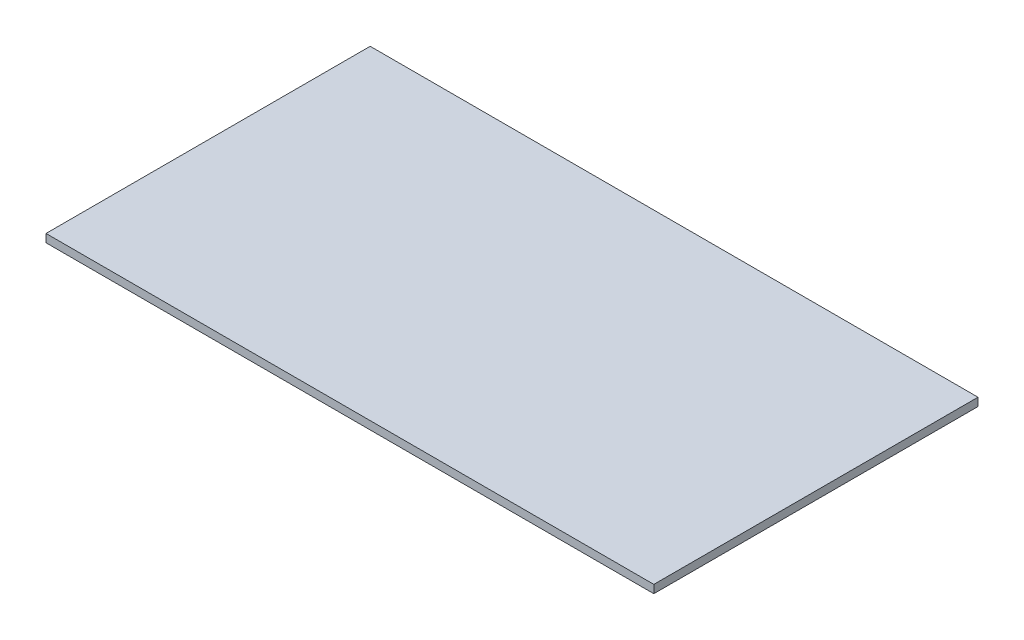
ISO-10303-21;
HEADER;
FILE_DESCRIPTION(('STEP AP214'),'2;1');
FILE_NAME('part.step','',(''),(''),'','','');
FILE_SCHEMA(('AUTOMOTIVE_DESIGN { 1 0 10303 214 1 1 1 1 }'));
ENDSEC;
DATA;
#1=APPLICATION_CONTEXT('core data for automotive mechanical design processes');
#2=APPLICATION_PROTOCOL_DEFINITION('international standard','automotive_design',2000,#1);
#3=PRODUCT_CONTEXT('',#1,'mechanical');
#4=PRODUCT('Part','Part','',(#3));
#5=PRODUCT_RELATED_PRODUCT_CATEGORY('part','',(#4));
#6=PRODUCT_DEFINITION_FORMATION('','',#4);
#7=PRODUCT_DEFINITION_CONTEXT('part definition',#1,'design');
#8=PRODUCT_DEFINITION('design','',#6,#7);
#9=PRODUCT_DEFINITION_SHAPE('','',#8);
#10=(LENGTH_UNIT() NAMED_UNIT(*) SI_UNIT(.MILLI.,.METRE.));
#11=(NAMED_UNIT(*) PLANE_ANGLE_UNIT() SI_UNIT($,.RADIAN.));
#12=(NAMED_UNIT(*) SI_UNIT($,.STERADIAN.) SOLID_ANGLE_UNIT());
#13=UNCERTAINTY_MEASURE_WITH_UNIT(LENGTH_MEASURE(1.E-05),#10,'distance_accuracy_value','');
#14=(GEOMETRIC_REPRESENTATION_CONTEXT(3) GLOBAL_UNCERTAINTY_ASSIGNED_CONTEXT((#13)) GLOBAL_UNIT_ASSIGNED_CONTEXT((#10,
#11,#12)) REPRESENTATION_CONTEXT('',''));
#15=CARTESIAN_POINT('',(0.,0.,0.));
#16=DIRECTION('',(0.,0.,1.));
#17=DIRECTION('',(1.,0.,0.));
#18=AXIS2_PLACEMENT_3D('',#15,#16,#17);
#19=CARTESIAN_POINT('',(75.,2.,40.));
#20=DIRECTION('',(-1.,0.,0.));
#21=DIRECTION('',(0.,0.,1.));
#22=AXIS2_PLACEMENT_3D('',#19,#20,#21);
#23=PLANE('',#22);
#24=DIRECTION('',(0.,0.,-1.));
#25=VECTOR('',#24,1.);
#26=CARTESIAN_POINT('',(75.,0.,40.));
#27=LINE('',#26,#25);
#28=CARTESIAN_POINT('',(75.,0.,40.));
#29=VERTEX_POINT('',#28);
#30=CARTESIAN_POINT('',(75.,0.,-40.));
#31=VERTEX_POINT('',#30);
#32=EDGE_CURVE('E98',#29,#31,#27,.T.);
#33=ORIENTED_EDGE('',*,*,#32,.T.);
#34=DIRECTION('',(0.,-1.,0.));
#35=VECTOR('',#34,1.);
#36=CARTESIAN_POINT('',(75.,2.,-40.));
#37=LINE('',#36,#35);
#38=CARTESIAN_POINT('',(75.,2.,-40.));
#39=VERTEX_POINT('',#38);
#40=EDGE_CURVE('E11',#39,#31,#37,.T.);
#41=ORIENTED_EDGE('',*,*,#40,.F.);
#42=DIRECTION('',(0.,0.,-1.));
#43=VECTOR('',#42,1.);
#44=CARTESIAN_POINT('',(75.,2.,40.));
#45=LINE('',#44,#43);
#46=CARTESIAN_POINT('',(75.,2.,40.));
#47=VERTEX_POINT('',#46);
#48=EDGE_CURVE('E86',#47,#39,#45,.T.);
#49=ORIENTED_EDGE('',*,*,#48,.F.);
#50=DIRECTION('',(0.,-1.,0.));
#51=VECTOR('',#50,1.);
#52=CARTESIAN_POINT('',(75.,2.,40.));
#53=LINE('',#52,#51);
#54=EDGE_CURVE('E94',#47,#29,#53,.T.);
#55=ORIENTED_EDGE('',*,*,#54,.T.);
#56=EDGE_LOOP('',(#33,#41,#49,#55));
#57=FACE_BOUND('',#56,.T.);
#58=ADVANCED_FACE('F35',(#57),#23,.F.);
#59=CARTESIAN_POINT('',(-75.,2.,-40.));
#60=DIRECTION('',(0.,0.,1.));
#61=DIRECTION('',(1.,0.,0.));
#62=AXIS2_PLACEMENT_3D('',#59,#60,#61);
#63=PLANE('',#62);
#64=DIRECTION('',(-1.,0.,0.));
#65=VECTOR('',#64,1.);
#66=CARTESIAN_POINT('',(-75.,0.,-40.));
#67=LINE('',#66,#65);
#68=CARTESIAN_POINT('',(-75.,0.,-40.));
#69=VERTEX_POINT('',#68);
#70=EDGE_CURVE('E90',#31,#69,#67,.T.);
#71=ORIENTED_EDGE('',*,*,#70,.T.);
#72=DIRECTION('',(0.,-1.,0.));
#73=VECTOR('',#72,1.);
#74=CARTESIAN_POINT('',(-75.,2.,-40.));
#75=LINE('',#74,#73);
#76=CARTESIAN_POINT('',(-75.,2.,-40.));
#77=VERTEX_POINT('',#76);
#78=EDGE_CURVE('E43',#77,#69,#75,.T.);
#79=ORIENTED_EDGE('',*,*,#78,.F.);
#80=DIRECTION('',(-1.,0.,0.));
#81=VECTOR('',#80,1.);
#82=CARTESIAN_POINT('',(-75.,2.,-40.));
#83=LINE('',#82,#81);
#84=EDGE_CURVE('E81',#39,#77,#83,.T.);
#85=ORIENTED_EDGE('',*,*,#84,.F.);
#86=ORIENTED_EDGE('',*,*,#40,.T.);
#87=EDGE_LOOP('',(#71,#79,#85,#86));
#88=FACE_BOUND('',#87,.T.);
#89=ADVANCED_FACE('F89',(#88),#63,.F.);
#90=CARTESIAN_POINT('',(-75.,2.,40.));
#91=DIRECTION('',(1.,0.,0.));
#92=DIRECTION('',(0.,0.,-1.));
#93=AXIS2_PLACEMENT_3D('',#90,#91,#92);
#94=PLANE('',#93);
#95=DIRECTION('',(0.,0.,1.));
#96=VECTOR('',#95,1.);
#97=CARTESIAN_POINT('',(-75.,0.,40.));
#98=LINE('',#97,#96);
#99=CARTESIAN_POINT('',(-75.,0.,40.));
#100=VERTEX_POINT('',#99);
#101=EDGE_CURVE('E68',#69,#100,#98,.T.);
#102=ORIENTED_EDGE('',*,*,#101,.T.);
#103=DIRECTION('',(0.,-1.,0.));
#104=VECTOR('',#103,1.);
#105=CARTESIAN_POINT('',(-75.,2.,40.));
#106=LINE('',#105,#104);
#107=CARTESIAN_POINT('',(-75.,2.,40.));
#108=VERTEX_POINT('',#107);
#109=EDGE_CURVE('E91',#108,#100,#106,.T.);
#110=ORIENTED_EDGE('',*,*,#109,.F.);
#111=DIRECTION('',(0.,0.,1.));
#112=VECTOR('',#111,1.);
#113=CARTESIAN_POINT('',(-75.,2.,40.));
#114=LINE('',#113,#112);
#115=EDGE_CURVE('E84',#77,#108,#114,.T.);
#116=ORIENTED_EDGE('',*,*,#115,.F.);
#117=ORIENTED_EDGE('',*,*,#78,.T.);
#118=EDGE_LOOP('',(#102,#110,#116,#117));
#119=FACE_BOUND('',#118,.T.);
#120=ADVANCED_FACE('F92',(#119),#94,.F.);
#121=CARTESIAN_POINT('',(-75.,2.,40.));
#122=DIRECTION('',(0.,0.,-1.));
#123=DIRECTION('',(-1.,0.,0.));
#124=AXIS2_PLACEMENT_3D('',#121,#122,#123);
#125=PLANE('',#124);
#126=DIRECTION('',(1.,0.,0.));
#127=VECTOR('',#126,1.);
#128=CARTESIAN_POINT('',(-75.,0.,40.));
#129=LINE('',#128,#127);
#130=EDGE_CURVE('E74',#100,#29,#129,.T.);
#131=ORIENTED_EDGE('',*,*,#130,.T.);
#132=ORIENTED_EDGE('',*,*,#54,.F.);
#133=DIRECTION('',(1.,0.,0.));
#134=VECTOR('',#133,1.);
#135=CARTESIAN_POINT('',(-75.,2.,40.));
#136=LINE('',#135,#134);
#137=EDGE_CURVE('E51',#108,#47,#136,.T.);
#138=ORIENTED_EDGE('',*,*,#137,.F.);
#139=ORIENTED_EDGE('',*,*,#109,.T.);
#140=EDGE_LOOP('',(#131,#132,#138,#139));
#141=FACE_BOUND('',#140,.T.);
#142=ADVANCED_FACE('F105',(#141),#125,.F.);
#143=CARTESIAN_POINT('',(0.,2.,0.));
#144=DIRECTION('',(0.,-1.,0.));
#145=DIRECTION('',(0.,0.,-1.));
#146=AXIS2_PLACEMENT_3D('',#143,#144,#145);
#147=PLANE('',#146);
#148=ORIENTED_EDGE('',*,*,#48,.T.);
#149=ORIENTED_EDGE('',*,*,#84,.T.);
#150=ORIENTED_EDGE('',*,*,#115,.T.);
#151=ORIENTED_EDGE('',*,*,#137,.T.);
#152=EDGE_LOOP('',(#148,#149,#150,#151));
#153=FACE_BOUND('',#152,.T.);
#154=ADVANCED_FACE('F82',(#153),#147,.F.);
#155=CARTESIAN_POINT('',(0.,0.,0.));
#156=DIRECTION('',(0.,-1.,0.));
#157=DIRECTION('',(0.,0.,-1.));
#158=AXIS2_PLACEMENT_3D('',#155,#156,#157);
#159=PLANE('',#158);
#160=ORIENTED_EDGE('',*,*,#32,.F.);
#161=ORIENTED_EDGE('',*,*,#130,.F.);
#162=ORIENTED_EDGE('',*,*,#101,.F.);
#163=ORIENTED_EDGE('',*,*,#70,.F.);
#164=EDGE_LOOP('',(#160,#161,#162,#163));
#165=FACE_BOUND('',#164,.T.);
#166=ADVANCED_FACE('F108',(#165),#159,.T.);
#167=CLOSED_SHELL('',(#58,#89,#120,#142,#154,#166));
#168=MANIFOLD_SOLID_BREP('B2',#167);
#169=ADVANCED_BREP_SHAPE_REPRESENTATION('',(#18,#168),#14);
#170=SHAPE_DEFINITION_REPRESENTATION(#9,#169);
ENDSEC;
END-ISO-10303-21;
